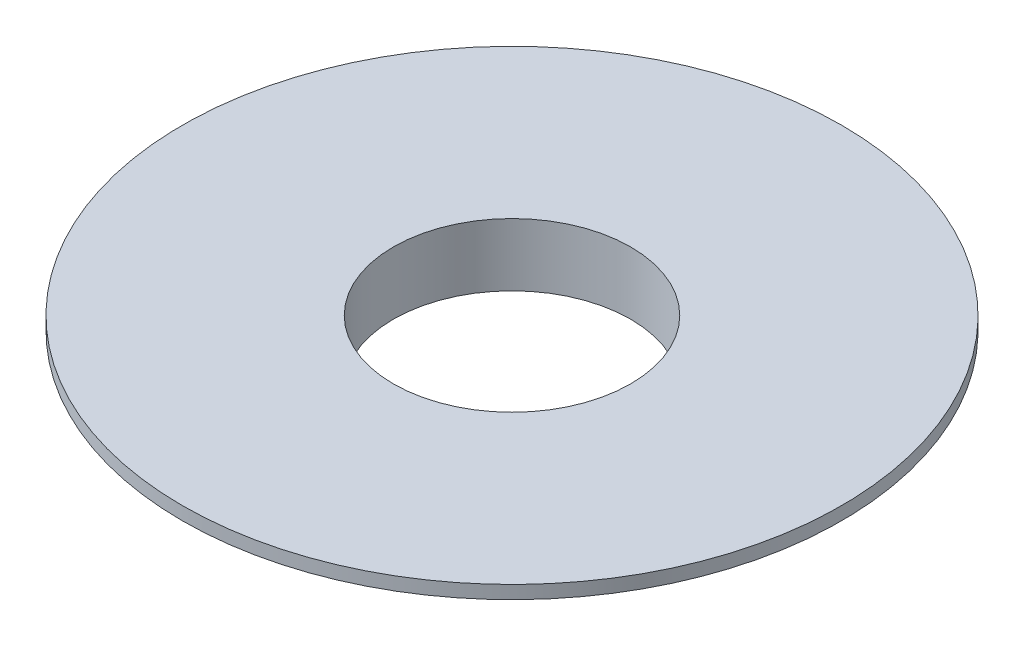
ISO-10303-21;
HEADER;
FILE_DESCRIPTION(('STEP AP214'),'2;1');
FILE_NAME('part.step','',(''),(''),'','','');
FILE_SCHEMA(('AUTOMOTIVE_DESIGN { 1 0 10303 214 1 1 1 1 }'));
ENDSEC;
DATA;
#1=APPLICATION_CONTEXT('core data for automotive mechanical design processes');
#2=APPLICATION_PROTOCOL_DEFINITION('international standard','automotive_design',2000,#1);
#3=PRODUCT_CONTEXT('',#1,'mechanical');
#4=PRODUCT('Part','Part','',(#3));
#5=PRODUCT_RELATED_PRODUCT_CATEGORY('part','',(#4));
#6=PRODUCT_DEFINITION_FORMATION('','',#4);
#7=PRODUCT_DEFINITION_CONTEXT('part definition',#1,'design');
#8=PRODUCT_DEFINITION('design','',#6,#7);
#9=PRODUCT_DEFINITION_SHAPE('','',#8);
#10=(LENGTH_UNIT() NAMED_UNIT(*) SI_UNIT(.MILLI.,.METRE.));
#11=(NAMED_UNIT(*) PLANE_ANGLE_UNIT() SI_UNIT($,.RADIAN.));
#12=(NAMED_UNIT(*) SI_UNIT($,.STERADIAN.) SOLID_ANGLE_UNIT());
#13=UNCERTAINTY_MEASURE_WITH_UNIT(LENGTH_MEASURE(1.E-05),#10,'distance_accuracy_value','');
#14=(GEOMETRIC_REPRESENTATION_CONTEXT(3) GLOBAL_UNCERTAINTY_ASSIGNED_CONTEXT((#13)) GLOBAL_UNIT_ASSIGNED_CONTEXT((#10,
#11,#12)) REPRESENTATION_CONTEXT('',''));
#15=CARTESIAN_POINT('',(0.,0.,0.));
#16=DIRECTION('',(0.,0.,1.));
#17=DIRECTION('',(1.,0.,0.));
#18=AXIS2_PLACEMENT_3D('',#15,#16,#17);
#19=CARTESIAN_POINT('',(50.,-6.83748173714,0.));
#20=DIRECTION('',(0.,-1.,0.));
#21=DIRECTION('',(0.,0.,-1.));
#22=AXIS2_PLACEMENT_3D('',#19,#20,#21);
#23=PLANE('',#22);
#24=CARTESIAN_POINT('',(0.,-6.83748173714,0.));
#25=DIRECTION('',(0.,1.,0.));
#26=DIRECTION('',(0.,0.,1.));
#27=AXIS2_PLACEMENT_3D('',#24,#25,#26);
#28=CIRCLE('',#27,22.);
#29=CARTESIAN_POINT('',(0.,-6.83748173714,22.));
#30=VERTEX_POINT('',#29);
#31=EDGE_CURVE('E55',#30,#30,#28,.T.);
#32=ORIENTED_EDGE('',*,*,#31,.T.);
#33=EDGE_LOOP('',(#32));
#34=FACE_BOUND('',#33,.T.);
#35=CARTESIAN_POINT('',(0.,-6.83748173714,0.));
#36=DIRECTION('',(0.,1.,0.));
#37=DIRECTION('',(0.,0.,1.));
#38=AXIS2_PLACEMENT_3D('',#35,#36,#37);
#39=CIRCLE('',#38,50.);
#40=CARTESIAN_POINT('',(0.,-6.83748173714,50.));
#41=VERTEX_POINT('',#40);
#42=EDGE_CURVE('E10',#41,#41,#39,.T.);
#43=ORIENTED_EDGE('',*,*,#42,.F.);
#44=EDGE_LOOP('',(#43));
#45=FACE_BOUND('',#44,.T.);
#46=ADVANCED_FACE('F33',(#34,#45),#23,.T.);
#47=CARTESIAN_POINT('',(0.,-14.3374817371,0.));
#48=DIRECTION('',(0.,1.,0.));
#49=DIRECTION('',(0.,0.,1.));
#50=AXIS2_PLACEMENT_3D('',#47,#48,#49);
#51=CYLINDRICAL_SURFACE('',#50,50.);
#52=ORIENTED_EDGE('',*,*,#42,.T.);
#53=EDGE_LOOP('',(#52));
#54=FACE_BOUND('',#53,.T.);
#55=CARTESIAN_POINT('',(0.,-4.83748173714,0.));
#56=DIRECTION('',(0.,1.,0.));
#57=DIRECTION('',(0.,0.,1.));
#58=AXIS2_PLACEMENT_3D('',#55,#56,#57);
#59=CIRCLE('',#58,50.);
#60=CARTESIAN_POINT('',(0.,-4.83748173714,50.));
#61=VERTEX_POINT('',#60);
#62=EDGE_CURVE('E39',#61,#61,#59,.T.);
#63=ORIENTED_EDGE('',*,*,#62,.F.);
#64=EDGE_LOOP('',(#63));
#65=FACE_BOUND('',#64,.T.);
#66=ADVANCED_FACE('F73',(#54,#65),#51,.T.);
#67=CARTESIAN_POINT('',(18.,-4.83748173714,0.));
#68=DIRECTION('',(0.,1.,0.));
#69=DIRECTION('',(0.,0.,1.));
#70=AXIS2_PLACEMENT_3D('',#67,#68,#69);
#71=PLANE('',#70);
#72=ORIENTED_EDGE('',*,*,#62,.T.);
#73=EDGE_LOOP('',(#72));
#74=FACE_BOUND('',#73,.T.);
#75=CARTESIAN_POINT('',(0.,-4.83748173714,0.));
#76=DIRECTION('',(0.,1.,0.));
#77=DIRECTION('',(0.,0.,1.));
#78=AXIS2_PLACEMENT_3D('',#75,#76,#77);
#79=CIRCLE('',#78,18.);
#80=CARTESIAN_POINT('',(0.,-4.83748173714,18.));
#81=VERTEX_POINT('',#80);
#82=EDGE_CURVE('E43',#81,#81,#79,.T.);
#83=ORIENTED_EDGE('',*,*,#82,.F.);
#84=EDGE_LOOP('',(#83));
#85=FACE_BOUND('',#84,.T.);
#86=ADVANCED_FACE('F77',(#74,#85),#71,.T.);
#87=CARTESIAN_POINT('',(0.,-14.3374817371,0.));
#88=DIRECTION('',(0.,1.,0.));
#89=DIRECTION('',(0.,0.,1.));
#90=AXIS2_PLACEMENT_3D('',#87,#88,#89);
#91=CYLINDRICAL_SURFACE('',#90,18.);
#92=ORIENTED_EDGE('',*,*,#82,.T.);
#93=EDGE_LOOP('',(#92));
#94=FACE_BOUND('',#93,.T.);
#95=CARTESIAN_POINT('',(0.,-14.3374817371,0.));
#96=DIRECTION('',(0.,1.,0.));
#97=DIRECTION('',(0.,0.,1.));
#98=AXIS2_PLACEMENT_3D('',#95,#96,#97);
#99=CIRCLE('',#98,18.);
#100=CARTESIAN_POINT('',(0.,-14.3374817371,18.));
#101=VERTEX_POINT('',#100);
#102=EDGE_CURVE('E47',#101,#101,#99,.T.);
#103=ORIENTED_EDGE('',*,*,#102,.F.);
#104=EDGE_LOOP('',(#103));
#105=FACE_BOUND('',#104,.T.);
#106=ADVANCED_FACE('F69',(#94,#105),#91,.F.);
#107=CARTESIAN_POINT('',(22.,-14.3374817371,0.));
#108=DIRECTION('',(0.,-1.,0.));
#109=DIRECTION('',(0.,0.,-1.));
#110=AXIS2_PLACEMENT_3D('',#107,#108,#109);
#111=PLANE('',#110);
#112=ORIENTED_EDGE('',*,*,#102,.T.);
#113=EDGE_LOOP('',(#112));
#114=FACE_BOUND('',#113,.T.);
#115=CARTESIAN_POINT('',(0.,-14.3374817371,0.));
#116=DIRECTION('',(0.,1.,0.));
#117=DIRECTION('',(0.,0.,1.));
#118=AXIS2_PLACEMENT_3D('',#115,#116,#117);
#119=CIRCLE('',#118,22.);
#120=CARTESIAN_POINT('',(0.,-14.3374817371,22.));
#121=VERTEX_POINT('',#120);
#122=EDGE_CURVE('E52',#121,#121,#119,.T.);
#123=ORIENTED_EDGE('',*,*,#122,.F.);
#124=EDGE_LOOP('',(#123));
#125=FACE_BOUND('',#124,.T.);
#126=ADVANCED_FACE('F63',(#114,#125),#111,.T.);
#127=CARTESIAN_POINT('',(0.,-14.3374817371,0.));
#128=DIRECTION('',(0.,1.,0.));
#129=DIRECTION('',(0.,0.,1.));
#130=AXIS2_PLACEMENT_3D('',#127,#128,#129);
#131=CYLINDRICAL_SURFACE('',#130,22.);
#132=ORIENTED_EDGE('',*,*,#122,.T.);
#133=EDGE_LOOP('',(#132));
#134=FACE_BOUND('',#133,.T.);
#135=ORIENTED_EDGE('',*,*,#31,.F.);
#136=EDGE_LOOP('',(#135));
#137=FACE_BOUND('',#136,.T.);
#138=ADVANCED_FACE('F61',(#134,#137),#131,.T.);
#139=CLOSED_SHELL('',(#46,#66,#86,#106,#126,#138));
#140=MANIFOLD_SOLID_BREP('B2',#139);
#141=ADVANCED_BREP_SHAPE_REPRESENTATION('',(#18,#140),#14);
#142=SHAPE_DEFINITION_REPRESENTATION(#9,#141);
ENDSEC;
END-ISO-10303-21;
